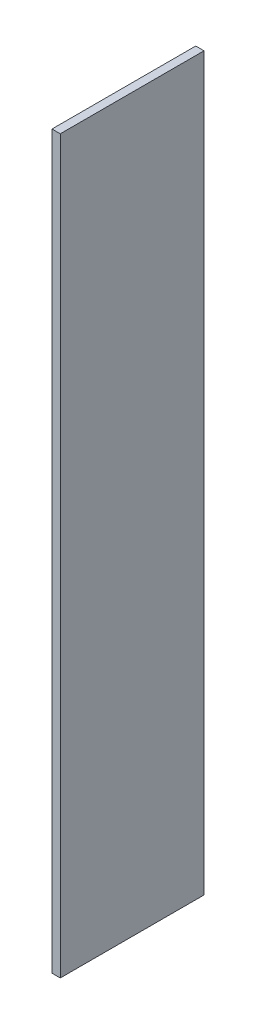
ISO-10303-21;
HEADER;
FILE_DESCRIPTION(('STEP AP214'),'2;1');
FILE_NAME('part.step','',(''),(''),'','','');
FILE_SCHEMA(('AUTOMOTIVE_DESIGN { 1 0 10303 214 1 1 1 1 }'));
ENDSEC;
DATA;
#1=APPLICATION_CONTEXT('core data for automotive mechanical design processes');
#2=APPLICATION_PROTOCOL_DEFINITION('international standard','automotive_design',2000,#1);
#3=PRODUCT_CONTEXT('',#1,'mechanical');
#4=PRODUCT('Part','Part','',(#3));
#5=PRODUCT_RELATED_PRODUCT_CATEGORY('part','',(#4));
#6=PRODUCT_DEFINITION_FORMATION('','',#4);
#7=PRODUCT_DEFINITION_CONTEXT('part definition',#1,'design');
#8=PRODUCT_DEFINITION('design','',#6,#7);
#9=PRODUCT_DEFINITION_SHAPE('','',#8);
#10=(LENGTH_UNIT() NAMED_UNIT(*) SI_UNIT(.MILLI.,.METRE.));
#11=(NAMED_UNIT(*) PLANE_ANGLE_UNIT() SI_UNIT($,.RADIAN.));
#12=(NAMED_UNIT(*) SI_UNIT($,.STERADIAN.) SOLID_ANGLE_UNIT());
#13=UNCERTAINTY_MEASURE_WITH_UNIT(LENGTH_MEASURE(1.E-05),#10,'distance_accuracy_value','');
#14=(GEOMETRIC_REPRESENTATION_CONTEXT(3) GLOBAL_UNCERTAINTY_ASSIGNED_CONTEXT((#13)) GLOBAL_UNIT_ASSIGNED_CONTEXT((#10,
#11,#12)) REPRESENTATION_CONTEXT('',''));
#15=CARTESIAN_POINT('',(0.,0.,0.));
#16=DIRECTION('',(0.,0.,1.));
#17=DIRECTION('',(1.,0.,0.));
#18=AXIS2_PLACEMENT_3D('',#15,#16,#17);
#19=CARTESIAN_POINT('',(3.2512,143.51,-28.2194));
#20=DIRECTION('',(0.,0.,1.));
#21=DIRECTION('',(0.,-1.,0.));
#22=AXIS2_PLACEMENT_3D('',#19,#20,#21);
#23=PLANE('',#22);
#24=DIRECTION('',(0.,1.,0.));
#25=VECTOR('',#24,1.);
#26=CARTESIAN_POINT('',(0.,143.51,-28.2194));
#27=LINE('',#26,#25);
#28=CARTESIAN_POINT('',(0.,-143.51,-28.2194));
#29=VERTEX_POINT('',#28);
#30=CARTESIAN_POINT('',(0.,143.51,-28.2194));
#31=VERTEX_POINT('',#30);
#32=EDGE_CURVE('E96',#29,#31,#27,.T.);
#33=ORIENTED_EDGE('',*,*,#32,.T.);
#34=DIRECTION('',(-1.,0.,0.));
#35=VECTOR('',#34,1.);
#36=CARTESIAN_POINT('',(3.2512,143.51,-28.2194));
#37=LINE('',#36,#35);
#38=CARTESIAN_POINT('',(3.2512,143.51,-28.2194));
#39=VERTEX_POINT('',#38);
#40=EDGE_CURVE('E11',#39,#31,#37,.T.);
#41=ORIENTED_EDGE('',*,*,#40,.F.);
#42=DIRECTION('',(0.,1.,0.));
#43=VECTOR('',#42,1.);
#44=CARTESIAN_POINT('',(3.2512,143.51,-28.2194));
#45=LINE('',#44,#43);
#46=CARTESIAN_POINT('',(3.2512,-143.51,-28.2194));
#47=VERTEX_POINT('',#46);
#48=EDGE_CURVE('E84',#47,#39,#45,.T.);
#49=ORIENTED_EDGE('',*,*,#48,.F.);
#50=DIRECTION('',(-1.,0.,0.));
#51=VECTOR('',#50,1.);
#52=CARTESIAN_POINT('',(3.2512,-143.51,-28.2194));
#53=LINE('',#52,#51);
#54=EDGE_CURVE('E92',#47,#29,#53,.T.);
#55=ORIENTED_EDGE('',*,*,#54,.T.);
#56=EDGE_LOOP('',(#33,#41,#49,#55));
#57=FACE_BOUND('',#56,.T.);
#58=ADVANCED_FACE('F33',(#57),#23,.F.);
#59=CARTESIAN_POINT('',(3.2512,143.51,28.2194));
#60=DIRECTION('',(0.,-1.,0.));
#61=DIRECTION('',(0.,0.,-1.));
#62=AXIS2_PLACEMENT_3D('',#59,#60,#61);
#63=PLANE('',#62);
#64=DIRECTION('',(0.,0.,1.));
#65=VECTOR('',#64,1.);
#66=CARTESIAN_POINT('',(0.,143.51,28.2194));
#67=LINE('',#66,#65);
#68=CARTESIAN_POINT('',(0.,143.51,28.2194));
#69=VERTEX_POINT('',#68);
#70=EDGE_CURVE('E88',#31,#69,#67,.T.);
#71=ORIENTED_EDGE('',*,*,#70,.T.);
#72=DIRECTION('',(-1.,0.,0.));
#73=VECTOR('',#72,1.);
#74=CARTESIAN_POINT('',(3.2512,143.51,28.2194));
#75=LINE('',#74,#73);
#76=CARTESIAN_POINT('',(3.2512,143.51,28.2194));
#77=VERTEX_POINT('',#76);
#78=EDGE_CURVE('E41',#77,#69,#75,.T.);
#79=ORIENTED_EDGE('',*,*,#78,.F.);
#80=DIRECTION('',(0.,0.,1.));
#81=VECTOR('',#80,1.);
#82=CARTESIAN_POINT('',(3.2512,143.51,28.2194));
#83=LINE('',#82,#81);
#84=EDGE_CURVE('E79',#39,#77,#83,.T.);
#85=ORIENTED_EDGE('',*,*,#84,.F.);
#86=ORIENTED_EDGE('',*,*,#40,.T.);
#87=EDGE_LOOP('',(#71,#79,#85,#86));
#88=FACE_BOUND('',#87,.T.);
#89=ADVANCED_FACE('F87',(#88),#63,.F.);
#90=CARTESIAN_POINT('',(3.2512,143.51,28.2194));
#91=DIRECTION('',(0.,0.,-1.));
#92=DIRECTION('',(0.,1.,0.));
#93=AXIS2_PLACEMENT_3D('',#90,#91,#92);
#94=PLANE('',#93);
#95=DIRECTION('',(0.,-1.,0.));
#96=VECTOR('',#95,1.);
#97=CARTESIAN_POINT('',(0.,143.51,28.2194));
#98=LINE('',#97,#96);
#99=CARTESIAN_POINT('',(0.,-143.51,28.2194));
#100=VERTEX_POINT('',#99);
#101=EDGE_CURVE('E66',#69,#100,#98,.T.);
#102=ORIENTED_EDGE('',*,*,#101,.T.);
#103=DIRECTION('',(-1.,0.,0.));
#104=VECTOR('',#103,1.);
#105=CARTESIAN_POINT('',(3.2512,-143.51,28.2194));
#106=LINE('',#105,#104);
#107=CARTESIAN_POINT('',(3.2512,-143.51,28.2194));
#108=VERTEX_POINT('',#107);
#109=EDGE_CURVE('E89',#108,#100,#106,.T.);
#110=ORIENTED_EDGE('',*,*,#109,.F.);
#111=DIRECTION('',(0.,-1.,0.));
#112=VECTOR('',#111,1.);
#113=CARTESIAN_POINT('',(3.2512,143.51,28.2194));
#114=LINE('',#113,#112);
#115=EDGE_CURVE('E82',#77,#108,#114,.T.);
#116=ORIENTED_EDGE('',*,*,#115,.F.);
#117=ORIENTED_EDGE('',*,*,#78,.T.);
#118=EDGE_LOOP('',(#102,#110,#116,#117));
#119=FACE_BOUND('',#118,.T.);
#120=ADVANCED_FACE('F90',(#119),#94,.F.);
#121=CARTESIAN_POINT('',(3.2512,-143.51,28.2194));
#122=DIRECTION('',(0.,1.,0.));
#123=DIRECTION('',(0.,0.,1.));
#124=AXIS2_PLACEMENT_3D('',#121,#122,#123);
#125=PLANE('',#124);
#126=DIRECTION('',(0.,0.,-1.));
#127=VECTOR('',#126,1.);
#128=CARTESIAN_POINT('',(0.,-143.51,28.2194));
#129=LINE('',#128,#127);
#130=EDGE_CURVE('E72',#100,#29,#129,.T.);
#131=ORIENTED_EDGE('',*,*,#130,.T.);
#132=ORIENTED_EDGE('',*,*,#54,.F.);
#133=DIRECTION('',(0.,0.,-1.));
#134=VECTOR('',#133,1.);
#135=CARTESIAN_POINT('',(3.2512,-143.51,28.2194));
#136=LINE('',#135,#134);
#137=EDGE_CURVE('E49',#108,#47,#136,.T.);
#138=ORIENTED_EDGE('',*,*,#137,.F.);
#139=ORIENTED_EDGE('',*,*,#109,.T.);
#140=EDGE_LOOP('',(#131,#132,#138,#139));
#141=FACE_BOUND('',#140,.T.);
#142=ADVANCED_FACE('F103',(#141),#125,.F.);
#143=CARTESIAN_POINT('',(3.2512,0.,0.));
#144=DIRECTION('',(1.,0.,0.));
#145=DIRECTION('',(0.,0.,-1.));
#146=AXIS2_PLACEMENT_3D('',#143,#144,#145);
#147=PLANE('',#146);
#148=ORIENTED_EDGE('',*,*,#48,.T.);
#149=ORIENTED_EDGE('',*,*,#84,.T.);
#150=ORIENTED_EDGE('',*,*,#115,.T.);
#151=ORIENTED_EDGE('',*,*,#137,.T.);
#152=EDGE_LOOP('',(#148,#149,#150,#151));
#153=FACE_BOUND('',#152,.T.);
#154=ADVANCED_FACE('F80',(#153),#147,.T.);
#155=CARTESIAN_POINT('',(0.,0.,0.));
#156=DIRECTION('',(1.,0.,0.));
#157=DIRECTION('',(0.,0.,-1.));
#158=AXIS2_PLACEMENT_3D('',#155,#156,#157);
#159=PLANE('',#158);
#160=ORIENTED_EDGE('',*,*,#32,.F.);
#161=ORIENTED_EDGE('',*,*,#130,.F.);
#162=ORIENTED_EDGE('',*,*,#101,.F.);
#163=ORIENTED_EDGE('',*,*,#70,.F.);
#164=EDGE_LOOP('',(#160,#161,#162,#163));
#165=FACE_BOUND('',#164,.T.);
#166=ADVANCED_FACE('F106',(#165),#159,.F.);
#167=CLOSED_SHELL('',(#58,#89,#120,#142,#154,#166));
#168=MANIFOLD_SOLID_BREP('B2',#167);
#169=ADVANCED_BREP_SHAPE_REPRESENTATION('',(#18,#168),#14);
#170=SHAPE_DEFINITION_REPRESENTATION(#9,#169);
ENDSEC;
END-ISO-10303-21;
